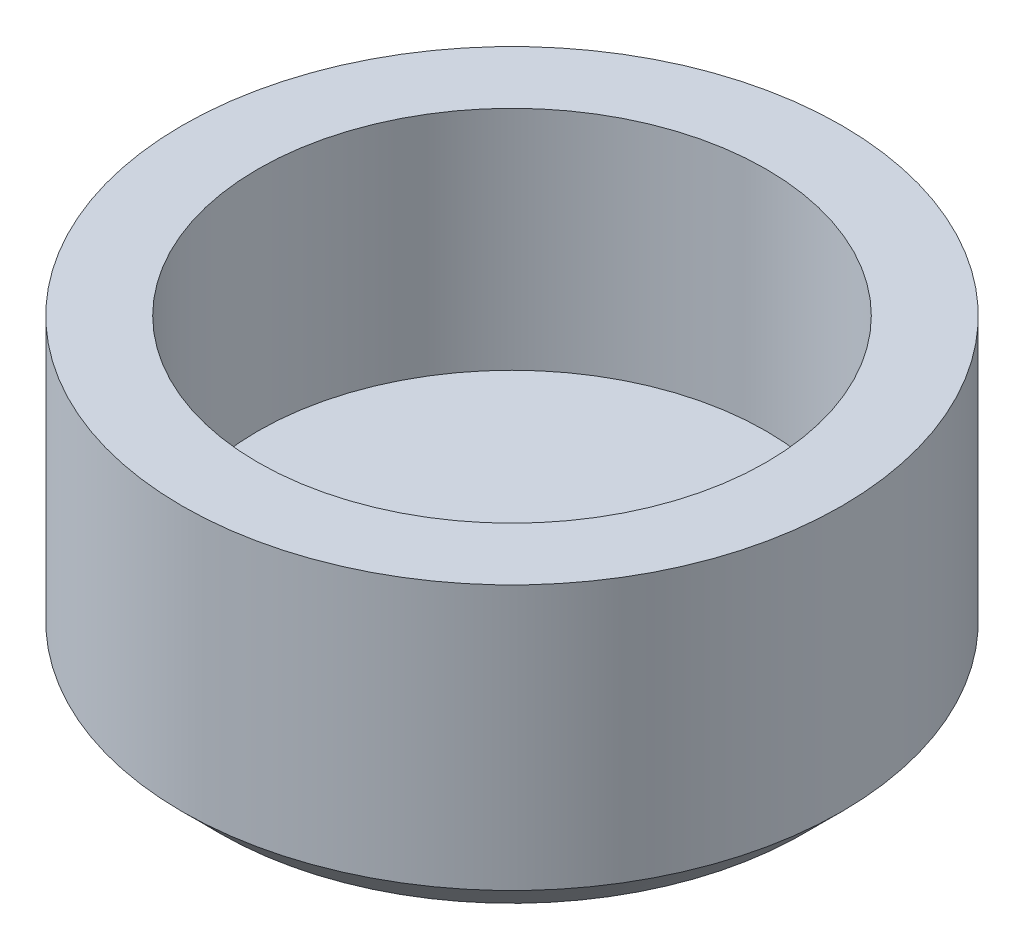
from build123d import *

# Parameters (mm, degrees)
CHAMFER1_SIZE = 1.5875


with BuildPart() as part:
    # Sketch2 → Revolve1 (revolve)
    with BuildSketch(Plane.XY, mode=Mode.PRIVATE) as revolve1_sk:
        Polygon((0, 0), (0, -3.175), (13.843, -3.175), (13.843, 9.525), (10.668, 9.525), (10.668, 0), align=None)
    revolve(revolve1_sk.sketch.rotate(Axis((0, 0, 0), (0, 1, 0)), 90), axis=Axis((0, 0, 0), (0, 1, 0)))

    # Chamfer1
    chamfer1_edges = [part.edges().sort_by_distance(p)[0] for p in [
        (0, -3.175, 13.843),
    ]]
    chamfer(chamfer1_edges, length=CHAMFER1_SIZE)


solid = part.part
